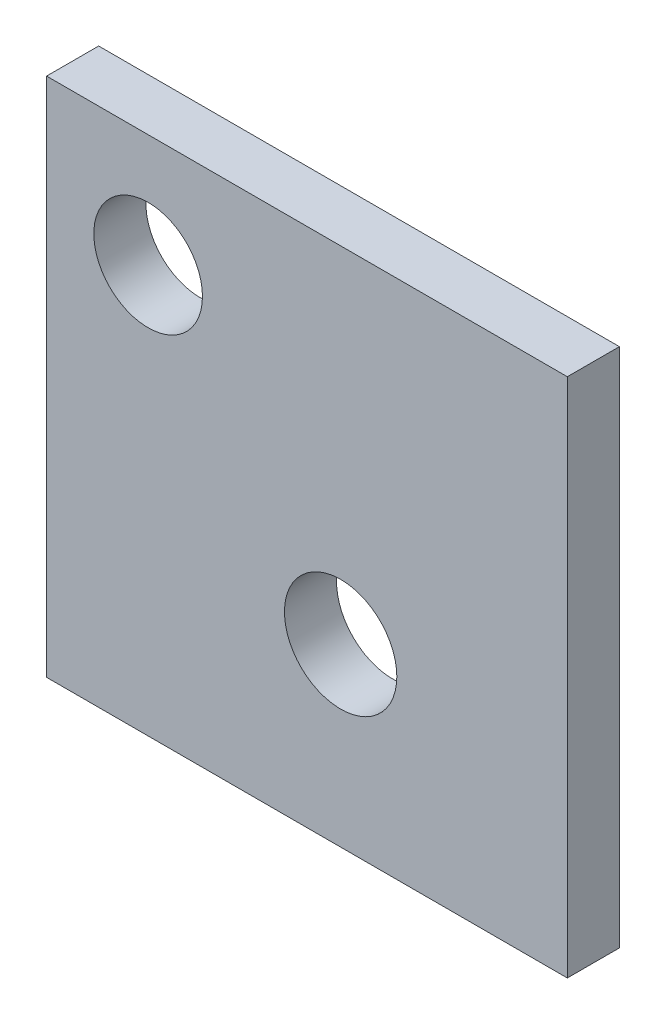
from build123d import *

# Parameters (mm, degrees)
ESQUISSE1_W             = 100
ESQUISSE1_H             = 100
BOSS_EXTRU_1_DEPTH      = 10
ESQUISSE2_R             = 10.429946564
ENL_V_MAT_EXTRU_1_DEPTH = 72.414284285
ESQUISSE3_R             = 10.788588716
ENL_V_MAT_EXTRU_2_DEPTH = 72.414284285


with BuildPart() as part:
    # Esquisse1 → Boss.-Extru.1 (new body)
    with BuildSketch(Plane.XY):
        Rectangle(ESQUISSE1_W, ESQUISSE1_H)
    extrude(amount=BOSS_EXTRU_1_DEPTH)

    # Esquisse2 → Enl_v. mat.-Extru.1 (cut, through all)
    with BuildSketch(Plane.XY.offset(10)):
        with Locations((-30.500305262, 28.319651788)):
            Circle(ESQUISSE2_R)
    extrude(amount=-ENL_V_MAT_EXTRU_1_DEPTH, mode=Mode.SUBTRACT)

    # Esquisse3 → Enl_v. mat.-Extru.2 (cut, through all)
    with BuildSketch(Plane.XY.offset(10)):
        with Locations((6.468829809, -16.25732015)):
            Circle(ESQUISSE3_R)
    extrude(amount=-ENL_V_MAT_EXTRU_2_DEPTH, mode=Mode.SUBTRACT)


solid = part.part
